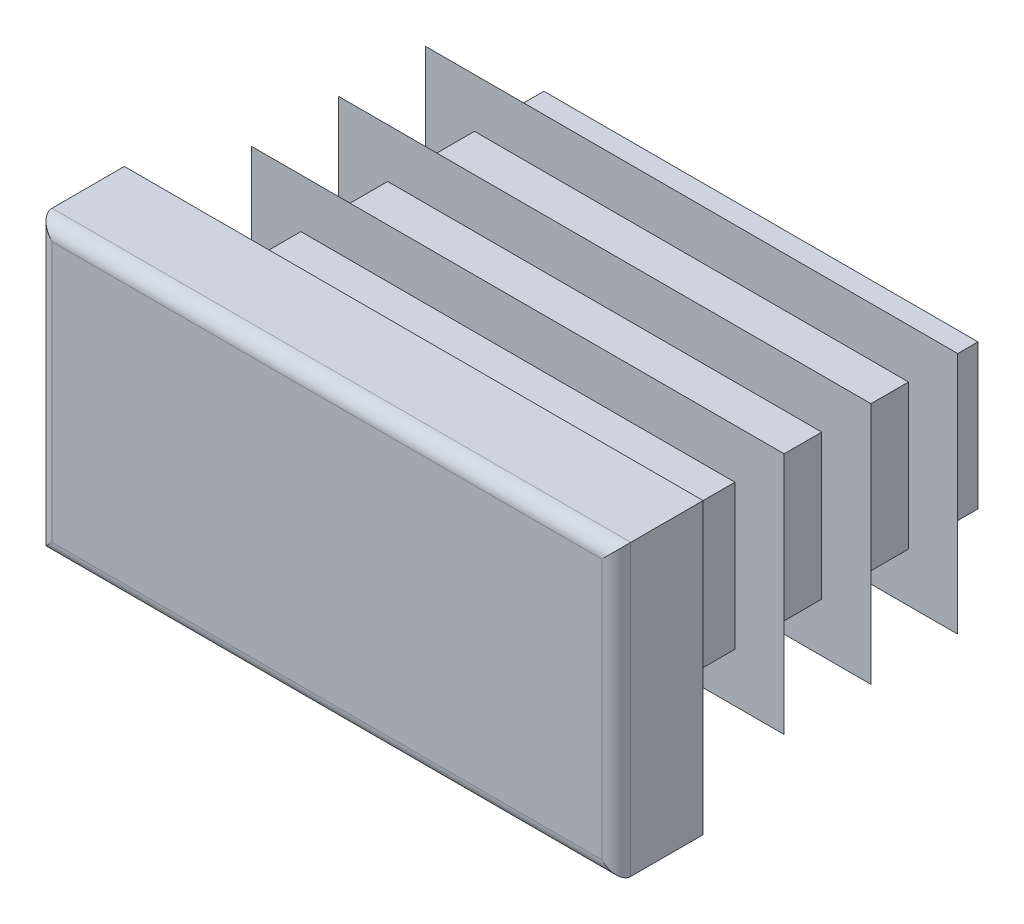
ISO-10303-21;
HEADER;
FILE_DESCRIPTION(('STEP AP214'),'2;1');
FILE_NAME('part.step','',(''),(''),'','','');
FILE_SCHEMA(('AUTOMOTIVE_DESIGN { 1 0 10303 214 1 1 1 1 }'));
ENDSEC;
DATA;
#1=APPLICATION_CONTEXT('core data for automotive mechanical design processes');
#2=APPLICATION_PROTOCOL_DEFINITION('international standard','automotive_design',2000,#1);
#3=PRODUCT_CONTEXT('',#1,'mechanical');
#4=PRODUCT('Part','Part','',(#3));
#5=PRODUCT_RELATED_PRODUCT_CATEGORY('part','',(#4));
#6=PRODUCT_DEFINITION_FORMATION('','',#4);
#7=PRODUCT_DEFINITION_CONTEXT('part definition',#1,'design');
#8=PRODUCT_DEFINITION('design','',#6,#7);
#9=PRODUCT_DEFINITION_SHAPE('','',#8);
#10=(LENGTH_UNIT() NAMED_UNIT(*) SI_UNIT(.MILLI.,.METRE.));
#11=(NAMED_UNIT(*) PLANE_ANGLE_UNIT() SI_UNIT($,.RADIAN.));
#12=(NAMED_UNIT(*) SI_UNIT($,.STERADIAN.) SOLID_ANGLE_UNIT());
#13=UNCERTAINTY_MEASURE_WITH_UNIT(LENGTH_MEASURE(1.E-05),#10,'distance_accuracy_value','');
#14=(GEOMETRIC_REPRESENTATION_CONTEXT(3) GLOBAL_UNCERTAINTY_ASSIGNED_CONTEXT((#13)) GLOBAL_UNIT_ASSIGNED_CONTEXT((#10,
#11,#12)) REPRESENTATION_CONTEXT('',''));
#15=CARTESIAN_POINT('',(0.,0.,0.));
#16=DIRECTION('',(0.,0.,1.));
#17=DIRECTION('',(1.,0.,0.));
#18=AXIS2_PLACEMENT_3D('',#15,#16,#17);
#19=CARTESIAN_POINT('',(9.5,-5.,3.));
#20=DIRECTION('',(0.,0.,-1.));
#21=DIRECTION('',(0.,1.,0.));
#22=AXIS2_PLACEMENT_3D('',#19,#20,#21);
#23=PLANE('',#22);
#24=DIRECTION('',(0.,1.,0.));
#25=VECTOR('',#24,1.);
#26=CARTESIAN_POINT('',(-9.5,-5.,3.));
#27=LINE('',#26,#25);
#28=CARTESIAN_POINT('',(-9.5,-4.5,3.));
#29=VERTEX_POINT('',#28);
#30=CARTESIAN_POINT('',(-9.5,4.5,3.));
#31=VERTEX_POINT('',#30);
#32=EDGE_CURVE('E310',#29,#31,#27,.T.);
#33=ORIENTED_EDGE('',*,*,#32,.F.);
#34=DIRECTION('',(-1.,0.,0.));
#35=VECTOR('',#34,1.);
#36=CARTESIAN_POINT('',(10.,-4.5,3.));
#37=LINE('',#36,#35);
#38=CARTESIAN_POINT('',(9.5,-4.5,3.));
#39=VERTEX_POINT('',#38);
#40=EDGE_CURVE('E482',#39,#29,#37,.T.);
#41=ORIENTED_EDGE('',*,*,#40,.F.);
#42=DIRECTION('',(0.,1.,0.));
#43=VECTOR('',#42,1.);
#44=CARTESIAN_POINT('',(9.5,-5.,3.));
#45=LINE('',#44,#43);
#46=CARTESIAN_POINT('',(9.5,4.5,3.));
#47=VERTEX_POINT('',#46);
#48=EDGE_CURVE('E305',#39,#47,#45,.T.);
#49=ORIENTED_EDGE('',*,*,#48,.T.);
#50=DIRECTION('',(-1.,0.,0.));
#51=VECTOR('',#50,1.);
#52=CARTESIAN_POINT('',(10.,4.5,3.));
#53=LINE('',#52,#51);
#54=EDGE_CURVE('E630',#47,#31,#53,.T.);
#55=ORIENTED_EDGE('',*,*,#54,.T.);
#56=EDGE_LOOP('',(#33,#41,#49,#55));
#57=FACE_BOUND('',#56,.T.);
#58=ADVANCED_FACE('F14',(#57),#23,.F.);
#59=CARTESIAN_POINT('',(-9.5,-5.,2.5));
#60=DIRECTION('',(0.,1.,0.));
#61=DIRECTION('',(-1.,0.,0.));
#62=AXIS2_PLACEMENT_3D('',#59,#60,#61);
#63=CYLINDRICAL_SURFACE('',#62,0.5);
#64=DIRECTION('',(0.,1.,0.));
#65=VECTOR('',#64,1.);
#66=CARTESIAN_POINT('',(-10.,-5.,2.5));
#67=LINE('',#66,#65);
#68=CARTESIAN_POINT('',(-10.,-5.,2.5));
#69=VERTEX_POINT('',#68);
#70=CARTESIAN_POINT('',(-10.,5.,2.5));
#71=VERTEX_POINT('',#70);
#72=EDGE_CURVE('E402',#69,#71,#67,.T.);
#73=ORIENTED_EDGE('',*,*,#72,.F.);
#74=CARTESIAN_POINT('',(-9.5,-4.5,2.5));
#75=DIRECTION('',(-0.707106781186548,0.707106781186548,0.));
#76=DIRECTION('',(0.707106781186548,0.707106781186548,0.));
#77=AXIS2_PLACEMENT_3D('',#74,#75,#76);
#78=ELLIPSE('',#77,0.707106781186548,0.5);
#79=EDGE_CURVE('E59',#69,#29,#78,.T.);
#80=ORIENTED_EDGE('',*,*,#79,.T.);
#81=ORIENTED_EDGE('',*,*,#32,.T.);
#82=CARTESIAN_POINT('',(-9.5,4.5,2.5));
#83=DIRECTION('',(0.707106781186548,0.707106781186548,0.));
#84=DIRECTION('',(-0.707106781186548,0.707106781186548,0.));
#85=AXIS2_PLACEMENT_3D('',#82,#83,#84);
#86=ELLIPSE('',#85,0.707106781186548,0.5);
#87=EDGE_CURVE('E306',#31,#71,#86,.F.);
#88=ORIENTED_EDGE('',*,*,#87,.T.);
#89=EDGE_LOOP('',(#73,#80,#81,#88));
#90=FACE_BOUND('',#89,.T.);
#91=ADVANCED_FACE('F16',(#90),#63,.T.);
#92=CARTESIAN_POINT('',(-10.,-5.,2.5));
#93=DIRECTION('',(1.,0.,0.));
#94=DIRECTION('',(0.,1.,0.));
#95=AXIS2_PLACEMENT_3D('',#92,#93,#94);
#96=PLANE('',#95);
#97=DIRECTION('',(0.,0.,-1.));
#98=VECTOR('',#97,1.);
#99=CARTESIAN_POINT('',(-10.,5.,2.5));
#100=LINE('',#99,#98);
#101=CARTESIAN_POINT('',(-10.,5.,0.));
#102=VERTEX_POINT('',#101);
#103=EDGE_CURVE('E615',#71,#102,#100,.T.);
#104=ORIENTED_EDGE('',*,*,#103,.T.);
#105=DIRECTION('',(0.,1.,0.));
#106=VECTOR('',#105,1.);
#107=CARTESIAN_POINT('',(-10.,-5.,0.));
#108=LINE('',#107,#106);
#109=CARTESIAN_POINT('',(-10.,-5.,0.));
#110=VERTEX_POINT('',#109);
#111=EDGE_CURVE('E400',#110,#102,#108,.T.);
#112=ORIENTED_EDGE('',*,*,#111,.F.);
#113=DIRECTION('',(0.,0.,-1.));
#114=VECTOR('',#113,1.);
#115=CARTESIAN_POINT('',(-10.,-5.,2.5));
#116=LINE('',#115,#114);
#117=EDGE_CURVE('E616',#69,#110,#116,.T.);
#118=ORIENTED_EDGE('',*,*,#117,.F.);
#119=ORIENTED_EDGE('',*,*,#72,.T.);
#120=EDGE_LOOP('',(#104,#112,#118,#119));
#121=FACE_BOUND('',#120,.T.);
#122=ADVANCED_FACE('F697',(#121),#96,.F.);
#123=CARTESIAN_POINT('',(-7.5,-5.,0.));
#124=DIRECTION('',(1.,0.,0.));
#125=DIRECTION('',(0.,1.,0.));
#126=AXIS2_PLACEMENT_3D('',#123,#124,#125);
#127=PLANE('',#126);
#128=DIRECTION('',(0.,1.,0.));
#129=VECTOR('',#128,1.);
#130=CARTESIAN_POINT('',(-7.5,-5.,0.));
#131=LINE('',#130,#129);
#132=CARTESIAN_POINT('',(-7.5,-2.5,0.));
#133=VERTEX_POINT('',#132);
#134=CARTESIAN_POINT('',(-7.5,2.5,0.));
#135=VERTEX_POINT('',#134);
#136=EDGE_CURVE('E397',#133,#135,#131,.T.);
#137=ORIENTED_EDGE('',*,*,#136,.T.);
#138=DIRECTION('',(0.,0.,-1.));
#139=VECTOR('',#138,1.);
#140=CARTESIAN_POINT('',(-7.5,2.5,0.));
#141=LINE('',#140,#139);
#142=CARTESIAN_POINT('',(-7.5,2.5,-0.6));
#143=VERTEX_POINT('',#142);
#144=EDGE_CURVE('E495',#135,#143,#141,.T.);
#145=ORIENTED_EDGE('',*,*,#144,.T.);
#146=DIRECTION('',(0.,1.,0.));
#147=VECTOR('',#146,1.);
#148=CARTESIAN_POINT('',(-7.5,-5.,-0.6));
#149=LINE('',#148,#147);
#150=CARTESIAN_POINT('',(-7.5,-2.5,-0.6));
#151=VERTEX_POINT('',#150);
#152=EDGE_CURVE('E394',#151,#143,#149,.T.);
#153=ORIENTED_EDGE('',*,*,#152,.F.);
#154=DIRECTION('',(0.,0.,1.));
#155=VECTOR('',#154,1.);
#156=CARTESIAN_POINT('',(-7.5,-2.5,0.));
#157=LINE('',#156,#155);
#158=EDGE_CURVE('E489',#151,#133,#157,.T.);
#159=ORIENTED_EDGE('',*,*,#158,.T.);
#160=EDGE_LOOP('',(#137,#145,#153,#159));
#161=FACE_BOUND('',#160,.T.);
#162=ADVANCED_FACE('F787',(#161),#127,.F.);
#163=CARTESIAN_POINT('',(-9.2,-5.,-0.6));
#164=DIRECTION('',(0.342020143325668,0.,0.939692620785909));
#165=DIRECTION('',(-0.939692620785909,0.,0.342020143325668));
#166=AXIS2_PLACEMENT_3D('',#163,#164,#165);
#167=PLANE('',#166);
#168=DIRECTION('',(0.,1.,0.));
#169=VECTOR('',#168,1.);
#170=CARTESIAN_POINT('',(-9.2,-5.,-0.6));
#171=LINE('',#170,#169);
#172=CARTESIAN_POINT('',(-9.2,-4.2,-0.6));
#173=VERTEX_POINT('',#172);
#174=CARTESIAN_POINT('',(-9.2,4.2,-0.6));
#175=VERTEX_POINT('',#174);
#176=EDGE_CURVE('E392',#173,#175,#171,.T.);
#177=ORIENTED_EDGE('',*,*,#176,.T.);
#178=DIRECTION('',(0.844349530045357,-0.43889572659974,-0.307318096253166));
#179=VECTOR('',#178,1.);
#180=CARTESIAN_POINT('',(-5.79065111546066,2.42780897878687,-1.840901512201));
#181=LINE('',#180,#179);
#182=CARTESIAN_POINT('',(-7.5,3.31633428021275,-1.21874939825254));
#183=VERTEX_POINT('',#182);
#184=EDGE_CURVE('E519',#175,#183,#181,.T.);
#185=ORIENTED_EDGE('',*,*,#184,.T.);
#186=DIRECTION('',(0.,1.,0.));
#187=VECTOR('',#186,1.);
#188=CARTESIAN_POINT('',(-7.5,-5.,-1.21874939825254));
#189=LINE('',#188,#187);
#190=CARTESIAN_POINT('',(-7.5,-3.31633428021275,-1.21874939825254));
#191=VERTEX_POINT('',#190);
#192=EDGE_CURVE('E389',#191,#183,#189,.T.);
#193=ORIENTED_EDGE('',*,*,#192,.F.);
#194=DIRECTION('',(-0.844349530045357,-0.43889572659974,0.307318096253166));
#195=VECTOR('',#194,1.);
#196=CARTESIAN_POINT('',(-9.49646512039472,-4.35410356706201,-0.492095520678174));
#197=LINE('',#196,#195);
#198=EDGE_CURVE('E507',#191,#173,#197,.T.);
#199=ORIENTED_EDGE('',*,*,#198,.T.);
#200=EDGE_LOOP('',(#177,#185,#193,#199));
#201=FACE_BOUND('',#200,.T.);
#202=ADVANCED_FACE('F783',(#201),#167,.F.);
#203=CARTESIAN_POINT('',(-7.5,-5.,-1.21874939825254));
#204=DIRECTION('',(1.,0.,0.));
#205=DIRECTION('',(0.,1.,0.));
#206=AXIS2_PLACEMENT_3D('',#203,#204,#205);
#207=PLANE('',#206);
#208=ORIENTED_EDGE('',*,*,#192,.T.);
#209=DIRECTION('',(0.,-0.819152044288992,-0.573576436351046));
#210=VECTOR('',#209,1.);
#211=CARTESIAN_POINT('',(-7.5,-2.26400978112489,-5.12614837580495));
#212=LINE('',#211,#210);
#213=CARTESIAN_POINT('',(-7.5,2.5,-1.79035281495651));
#214=VERTEX_POINT('',#213);
#215=EDGE_CURVE('E516',#183,#214,#212,.T.);
#216=ORIENTED_EDGE('',*,*,#215,.T.);
#217=DIRECTION('',(0.,0.,-1.));
#218=VECTOR('',#217,1.);
#219=CARTESIAN_POINT('',(-7.5,2.5,-1.21874939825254));
#220=LINE('',#219,#218);
#221=CARTESIAN_POINT('',(-7.5,2.5,-3.6));
#222=VERTEX_POINT('',#221);
#223=EDGE_CURVE('E525',#214,#222,#220,.T.);
#224=ORIENTED_EDGE('',*,*,#223,.T.);
#225=DIRECTION('',(0.,1.,0.));
#226=VECTOR('',#225,1.);
#227=CARTESIAN_POINT('',(-7.5,-5.,-3.6));
#228=LINE('',#227,#226);
#229=CARTESIAN_POINT('',(-7.5,-2.5,-3.6));
#230=VERTEX_POINT('',#229);
#231=EDGE_CURVE('E386',#230,#222,#228,.T.);
#232=ORIENTED_EDGE('',*,*,#231,.F.);
#233=DIRECTION('',(0.,0.,1.));
#234=VECTOR('',#233,1.);
#235=CARTESIAN_POINT('',(-7.5,-2.5,-1.21874939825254));
#236=LINE('',#235,#234);
#237=CARTESIAN_POINT('',(-7.5,-2.5,-1.79035281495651));
#238=VERTEX_POINT('',#237);
#239=EDGE_CURVE('E522',#230,#238,#236,.T.);
#240=ORIENTED_EDGE('',*,*,#239,.T.);
#241=DIRECTION('',(0.,-0.819152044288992,0.573576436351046));
#242=VECTOR('',#241,1.);
#243=CARTESIAN_POINT('',(-7.5,-4.44609093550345,-0.427685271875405));
#244=LINE('',#243,#242);
#245=EDGE_CURVE('E504',#238,#191,#244,.T.);
#246=ORIENTED_EDGE('',*,*,#245,.T.);
#247=EDGE_LOOP('',(#208,#216,#224,#232,#240,#246));
#248=FACE_BOUND('',#247,.T.);
#249=ADVANCED_FACE('F779',(#248),#207,.F.);
#250=CARTESIAN_POINT('',(-9.2,-5.,-3.6));
#251=DIRECTION('',(0.342020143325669,0.,0.939692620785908));
#252=DIRECTION('',(-0.939692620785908,0.,0.342020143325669));
#253=AXIS2_PLACEMENT_3D('',#250,#251,#252);
#254=PLANE('',#253);
#255=DIRECTION('',(0.,1.,0.));
#256=VECTOR('',#255,1.);
#257=CARTESIAN_POINT('',(-9.2,-5.,-3.6));
#258=LINE('',#257,#256);
#259=CARTESIAN_POINT('',(-9.2,-4.2,-3.6));
#260=VERTEX_POINT('',#259);
#261=CARTESIAN_POINT('',(-9.2,4.2,-3.6));
#262=VERTEX_POINT('',#261);
#263=EDGE_CURVE('E384',#260,#262,#258,.T.);
#264=ORIENTED_EDGE('',*,*,#263,.T.);
#265=DIRECTION('',(0.844349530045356,-0.438895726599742,-0.307318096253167));
#266=VECTOR('',#265,1.);
#267=CARTESIAN_POINT('',(-5.79065111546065,2.42780897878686,-4.84090151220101));
#268=LINE('',#267,#266);
#269=CARTESIAN_POINT('',(-7.5,3.31633428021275,-4.21874939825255));
#270=VERTEX_POINT('',#269);
#271=EDGE_CURVE('E549',#262,#270,#268,.T.);
#272=ORIENTED_EDGE('',*,*,#271,.T.);
#273=DIRECTION('',(0.,1.,0.));
#274=VECTOR('',#273,1.);
#275=CARTESIAN_POINT('',(-7.5,-5.,-4.21874939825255));
#276=LINE('',#275,#274);
#277=CARTESIAN_POINT('',(-7.5,-3.31633428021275,-4.21874939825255));
#278=VERTEX_POINT('',#277);
#279=EDGE_CURVE('E381',#278,#270,#276,.T.);
#280=ORIENTED_EDGE('',*,*,#279,.F.);
#281=DIRECTION('',(-0.844349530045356,-0.438895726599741,0.307318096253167));
#282=VECTOR('',#281,1.);
#283=CARTESIAN_POINT('',(-9.49646512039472,-4.35410356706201,-3.49209552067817));
#284=LINE('',#283,#282);
#285=EDGE_CURVE('E537',#278,#260,#284,.T.);
#286=ORIENTED_EDGE('',*,*,#285,.T.);
#287=EDGE_LOOP('',(#264,#272,#280,#286));
#288=FACE_BOUND('',#287,.T.);
#289=ADVANCED_FACE('F775',(#288),#254,.F.);
#290=CARTESIAN_POINT('',(-7.5,-5.,-4.21874939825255));
#291=DIRECTION('',(1.,0.,0.));
#292=DIRECTION('',(0.,1.,0.));
#293=AXIS2_PLACEMENT_3D('',#290,#291,#292);
#294=PLANE('',#293);
#295=ORIENTED_EDGE('',*,*,#279,.T.);
#296=DIRECTION('',(0.,-0.819152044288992,-0.573576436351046));
#297=VECTOR('',#296,1.);
#298=CARTESIAN_POINT('',(-7.5,-2.2640097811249,-8.12614837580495));
#299=LINE('',#298,#297);
#300=CARTESIAN_POINT('',(-7.5,2.5,-4.79035281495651));
#301=VERTEX_POINT('',#300);
#302=EDGE_CURVE('E546',#270,#301,#299,.T.);
#303=ORIENTED_EDGE('',*,*,#302,.T.);
#304=DIRECTION('',(0.,0.,-1.));
#305=VECTOR('',#304,1.);
#306=CARTESIAN_POINT('',(-7.5,2.5,-4.21874939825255));
#307=LINE('',#306,#305);
#308=CARTESIAN_POINT('',(-7.5,2.5,-6.6));
#309=VERTEX_POINT('',#308);
#310=EDGE_CURVE('E555',#301,#309,#307,.T.);
#311=ORIENTED_EDGE('',*,*,#310,.T.);
#312=DIRECTION('',(0.,1.,0.));
#313=VECTOR('',#312,1.);
#314=CARTESIAN_POINT('',(-7.5,-5.,-6.6));
#315=LINE('',#314,#313);
#316=CARTESIAN_POINT('',(-7.5,-2.5,-6.6));
#317=VERTEX_POINT('',#316);
#318=EDGE_CURVE('E378',#317,#309,#315,.T.);
#319=ORIENTED_EDGE('',*,*,#318,.F.);
#320=DIRECTION('',(0.,0.,1.));
#321=VECTOR('',#320,1.);
#322=CARTESIAN_POINT('',(-7.5,-2.5,-4.21874939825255));
#323=LINE('',#322,#321);
#324=CARTESIAN_POINT('',(-7.5,-2.5,-4.79035281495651));
#325=VERTEX_POINT('',#324);
#326=EDGE_CURVE('E552',#317,#325,#323,.T.);
#327=ORIENTED_EDGE('',*,*,#326,.T.);
#328=DIRECTION('',(0.,-0.819152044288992,0.573576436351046));
#329=VECTOR('',#328,1.);
#330=CARTESIAN_POINT('',(-7.5,-4.44609093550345,-3.42768527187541));
#331=LINE('',#330,#329);
#332=EDGE_CURVE('E534',#325,#278,#331,.T.);
#333=ORIENTED_EDGE('',*,*,#332,.T.);
#334=EDGE_LOOP('',(#295,#303,#311,#319,#327,#333));
#335=FACE_BOUND('',#334,.T.);
#336=ADVANCED_FACE('F771',(#335),#294,.F.);
#337=CARTESIAN_POINT('',(-9.2,-5.,-6.6));
#338=DIRECTION('',(0.342020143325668,0.,0.939692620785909));
#339=DIRECTION('',(-0.939692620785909,0.,0.342020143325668));
#340=AXIS2_PLACEMENT_3D('',#337,#338,#339);
#341=PLANE('',#340);
#342=DIRECTION('',(0.,1.,0.));
#343=VECTOR('',#342,1.);
#344=CARTESIAN_POINT('',(-9.2,-5.,-6.6));
#345=LINE('',#344,#343);
#346=CARTESIAN_POINT('',(-9.2,-4.2,-6.6));
#347=VERTEX_POINT('',#346);
#348=CARTESIAN_POINT('',(-9.2,4.2,-6.6));
#349=VERTEX_POINT('',#348);
#350=EDGE_CURVE('E376',#347,#349,#345,.T.);
#351=ORIENTED_EDGE('',*,*,#350,.T.);
#352=DIRECTION('',(0.844349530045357,-0.43889572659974,-0.307318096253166));
#353=VECTOR('',#352,1.);
#354=CARTESIAN_POINT('',(-5.79065111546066,2.42780897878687,-7.840901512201));
#355=LINE('',#354,#353);
#356=CARTESIAN_POINT('',(-7.5,3.31633428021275,-7.21874939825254));
#357=VERTEX_POINT('',#356);
#358=EDGE_CURVE('E579',#349,#357,#355,.T.);
#359=ORIENTED_EDGE('',*,*,#358,.T.);
#360=DIRECTION('',(0.,1.,0.));
#361=VECTOR('',#360,1.);
#362=CARTESIAN_POINT('',(-7.5,-5.,-7.21874939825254));
#363=LINE('',#362,#361);
#364=CARTESIAN_POINT('',(-7.5,-3.31633428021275,-7.21874939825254));
#365=VERTEX_POINT('',#364);
#366=EDGE_CURVE('E373',#365,#357,#363,.T.);
#367=ORIENTED_EDGE('',*,*,#366,.F.);
#368=DIRECTION('',(-0.844349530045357,-0.43889572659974,0.307318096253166));
#369=VECTOR('',#368,1.);
#370=CARTESIAN_POINT('',(-9.49646512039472,-4.35410356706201,-6.49209552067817));
#371=LINE('',#370,#369);
#372=EDGE_CURVE('E567',#365,#347,#371,.T.);
#373=ORIENTED_EDGE('',*,*,#372,.T.);
#374=EDGE_LOOP('',(#351,#359,#367,#373));
#375=FACE_BOUND('',#374,.T.);
#376=ADVANCED_FACE('F767',(#375),#341,.F.);
#377=CARTESIAN_POINT('',(-7.5,-5.,-7.21874939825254));
#378=DIRECTION('',(1.,0.,0.));
#379=DIRECTION('',(0.,1.,0.));
#380=AXIS2_PLACEMENT_3D('',#377,#378,#379);
#381=PLANE('',#380);
#382=ORIENTED_EDGE('',*,*,#366,.T.);
#383=DIRECTION('',(0.,-0.819152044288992,-0.573576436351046));
#384=VECTOR('',#383,1.);
#385=CARTESIAN_POINT('',(-7.5,-2.26400978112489,-11.1261483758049));
#386=LINE('',#385,#384);
#387=CARTESIAN_POINT('',(-7.5,2.5,-7.79035281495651));
#388=VERTEX_POINT('',#387);
#389=EDGE_CURVE('E576',#357,#388,#386,.T.);
#390=ORIENTED_EDGE('',*,*,#389,.T.);
#391=DIRECTION('',(0.,0.,-1.));
#392=VECTOR('',#391,1.);
#393=CARTESIAN_POINT('',(-7.5,2.5,-7.21874939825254));
#394=LINE('',#393,#392);
#395=CARTESIAN_POINT('',(-7.5,2.5,-9.6));
#396=VERTEX_POINT('',#395);
#397=EDGE_CURVE('E585',#388,#396,#394,.T.);
#398=ORIENTED_EDGE('',*,*,#397,.T.);
#399=DIRECTION('',(0.,1.,0.));
#400=VECTOR('',#399,1.);
#401=CARTESIAN_POINT('',(-7.5,-5.,-9.6));
#402=LINE('',#401,#400);
#403=CARTESIAN_POINT('',(-7.5,-2.5,-9.6));
#404=VERTEX_POINT('',#403);
#405=EDGE_CURVE('E370',#404,#396,#402,.T.);
#406=ORIENTED_EDGE('',*,*,#405,.F.);
#407=DIRECTION('',(0.,0.,1.));
#408=VECTOR('',#407,1.);
#409=CARTESIAN_POINT('',(-7.5,-2.5,-7.21874939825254));
#410=LINE('',#409,#408);
#411=CARTESIAN_POINT('',(-7.5,-2.5,-7.79035281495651));
#412=VERTEX_POINT('',#411);
#413=EDGE_CURVE('E582',#404,#412,#410,.T.);
#414=ORIENTED_EDGE('',*,*,#413,.T.);
#415=DIRECTION('',(0.,-0.819152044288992,0.573576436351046));
#416=VECTOR('',#415,1.);
#417=CARTESIAN_POINT('',(-7.5,-4.44609093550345,-6.42768527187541));
#418=LINE('',#417,#416);
#419=EDGE_CURVE('E564',#412,#365,#418,.T.);
#420=ORIENTED_EDGE('',*,*,#419,.T.);
#421=EDGE_LOOP('',(#382,#390,#398,#406,#414,#420));
#422=FACE_BOUND('',#421,.T.);
#423=ADVANCED_FACE('F764',(#422),#381,.F.);
#424=CARTESIAN_POINT('',(-9.2,-5.,-9.6));
#425=DIRECTION('',(0.342020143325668,0.,0.939692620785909));
#426=DIRECTION('',(-0.939692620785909,0.,0.342020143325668));
#427=AXIS2_PLACEMENT_3D('',#424,#425,#426);
#428=PLANE('',#427);
#429=DIRECTION('',(0.,1.,0.));
#430=VECTOR('',#429,1.);
#431=CARTESIAN_POINT('',(-9.2,-5.,-9.6));
#432=LINE('',#431,#430);
#433=CARTESIAN_POINT('',(-9.2,-4.2,-9.6));
#434=VERTEX_POINT('',#433);
#435=CARTESIAN_POINT('',(-9.2,4.2,-9.6));
#436=VERTEX_POINT('',#435);
#437=EDGE_CURVE('E368',#434,#436,#432,.T.);
#438=ORIENTED_EDGE('',*,*,#437,.T.);
#439=DIRECTION('',(0.844349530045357,-0.438895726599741,-0.307318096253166));
#440=VECTOR('',#439,1.);
#441=CARTESIAN_POINT('',(-5.79065111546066,2.42780897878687,-10.840901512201));
#442=LINE('',#441,#440);
#443=CARTESIAN_POINT('',(-7.5,3.31633428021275,-10.2187493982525));
#444=VERTEX_POINT('',#443);
#445=EDGE_CURVE('E607',#436,#444,#442,.T.);
#446=ORIENTED_EDGE('',*,*,#445,.T.);
#447=DIRECTION('',(0.,1.,0.));
#448=VECTOR('',#447,1.);
#449=CARTESIAN_POINT('',(-7.5,-5.,-10.2187493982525));
#450=LINE('',#449,#448);
#451=CARTESIAN_POINT('',(-7.5,-3.31633428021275,-10.2187493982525));
#452=VERTEX_POINT('',#451);
#453=EDGE_CURVE('E365',#452,#444,#450,.T.);
#454=ORIENTED_EDGE('',*,*,#453,.F.);
#455=DIRECTION('',(-0.844349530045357,-0.438895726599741,0.307318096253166));
#456=VECTOR('',#455,1.);
#457=CARTESIAN_POINT('',(-9.49646512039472,-4.35410356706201,-9.49209552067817));
#458=LINE('',#457,#456);
#459=EDGE_CURVE('E595',#452,#434,#458,.T.);
#460=ORIENTED_EDGE('',*,*,#459,.T.);
#461=EDGE_LOOP('',(#438,#446,#454,#460));
#462=FACE_BOUND('',#461,.T.);
#463=ADVANCED_FACE('F675',(#462),#428,.F.);
#464=CARTESIAN_POINT('',(-7.5,-5.,-10.2187493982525));
#465=DIRECTION('',(1.,0.,0.));
#466=DIRECTION('',(0.,1.,0.));
#467=AXIS2_PLACEMENT_3D('',#464,#465,#466);
#468=PLANE('',#467);
#469=ORIENTED_EDGE('',*,*,#453,.T.);
#470=DIRECTION('',(0.,-0.819152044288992,-0.573576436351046));
#471=VECTOR('',#470,1.);
#472=CARTESIAN_POINT('',(-7.5,-2.26400978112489,-14.1261483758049));
#473=LINE('',#472,#471);
#474=CARTESIAN_POINT('',(-7.5,2.5,-10.7903528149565));
#475=VERTEX_POINT('',#474);
#476=EDGE_CURVE('E604',#444,#475,#473,.T.);
#477=ORIENTED_EDGE('',*,*,#476,.T.);
#478=DIRECTION('',(0.,0.,-1.));
#479=VECTOR('',#478,1.);
#480=CARTESIAN_POINT('',(-7.5,2.5,-10.2187493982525));
#481=LINE('',#480,#479);
#482=CARTESIAN_POINT('',(-7.5,2.5,-12.));
#483=VERTEX_POINT('',#482);
#484=EDGE_CURVE('E613',#475,#483,#481,.T.);
#485=ORIENTED_EDGE('',*,*,#484,.T.);
#486=DIRECTION('',(0.,1.,0.));
#487=VECTOR('',#486,1.);
#488=CARTESIAN_POINT('',(-7.5,-5.,-12.));
#489=LINE('',#488,#487);
#490=CARTESIAN_POINT('',(-7.5,-2.5,-12.));
#491=VERTEX_POINT('',#490);
#492=EDGE_CURVE('E362',#491,#483,#489,.T.);
#493=ORIENTED_EDGE('',*,*,#492,.F.);
#494=DIRECTION('',(0.,0.,1.));
#495=VECTOR('',#494,1.);
#496=CARTESIAN_POINT('',(-7.5,-2.5,-10.2187493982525));
#497=LINE('',#496,#495);
#498=CARTESIAN_POINT('',(-7.5,-2.5,-10.7903528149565));
#499=VERTEX_POINT('',#498);
#500=EDGE_CURVE('E610',#491,#499,#497,.T.);
#501=ORIENTED_EDGE('',*,*,#500,.T.);
#502=DIRECTION('',(0.,-0.819152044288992,0.573576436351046));
#503=VECTOR('',#502,1.);
#504=CARTESIAN_POINT('',(-7.5,-4.44609093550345,-9.4276852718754));
#505=LINE('',#504,#503);
#506=EDGE_CURVE('E592',#499,#452,#505,.T.);
#507=ORIENTED_EDGE('',*,*,#506,.T.);
#508=EDGE_LOOP('',(#469,#477,#485,#493,#501,#507));
#509=FACE_BOUND('',#508,.T.);
#510=ADVANCED_FACE('F677',(#509),#468,.F.);
#511=CARTESIAN_POINT('',(-7.5,-5.,-12.));
#512=DIRECTION('',(0.,0.,1.));
#513=DIRECTION('',(0.,-1.,0.));
#514=AXIS2_PLACEMENT_3D('',#511,#512,#513);
#515=PLANE('',#514);
#516=ORIENTED_EDGE('',*,*,#492,.T.);
#517=DIRECTION('',(-1.,0.,0.));
#518=VECTOR('',#517,1.);
#519=CARTESIAN_POINT('',(10.,2.5,-12.));
#520=LINE('',#519,#518);
#521=CARTESIAN_POINT('',(7.5,2.5,-12.));
#522=VERTEX_POINT('',#521);
#523=EDGE_CURVE('E438',#522,#483,#520,.T.);
#524=ORIENTED_EDGE('',*,*,#523,.F.);
#525=DIRECTION('',(0.,1.,0.));
#526=VECTOR('',#525,1.);
#527=CARTESIAN_POINT('',(7.5,-5.,-12.));
#528=LINE('',#527,#526);
#529=CARTESIAN_POINT('',(7.5,-2.5,-12.));
#530=VERTEX_POINT('',#529);
#531=EDGE_CURVE('E359',#530,#522,#528,.T.);
#532=ORIENTED_EDGE('',*,*,#531,.F.);
#533=DIRECTION('',(-1.,0.,0.));
#534=VECTOR('',#533,1.);
#535=CARTESIAN_POINT('',(10.,-2.5,-12.));
#536=LINE('',#535,#534);
#537=EDGE_CURVE('E436',#530,#491,#536,.T.);
#538=ORIENTED_EDGE('',*,*,#537,.T.);
#539=EDGE_LOOP('',(#516,#524,#532,#538));
#540=FACE_BOUND('',#539,.T.);
#541=ADVANCED_FACE('F435',(#540),#515,.F.);
#542=CARTESIAN_POINT('',(7.5,-5.,-12.));
#543=DIRECTION('',(-1.,0.,0.));
#544=DIRECTION('',(0.,-1.,0.));
#545=AXIS2_PLACEMENT_3D('',#542,#543,#544);
#546=PLANE('',#545);
#547=DIRECTION('',(0.,0.,1.));
#548=VECTOR('',#547,1.);
#549=CARTESIAN_POINT('',(7.5,2.5,-12.));
#550=LINE('',#549,#548);
#551=CARTESIAN_POINT('',(7.5,2.5,-10.7903528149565));
#552=VERTEX_POINT('',#551);
#553=EDGE_CURVE('E9',#522,#552,#550,.T.);
#554=ORIENTED_EDGE('',*,*,#553,.T.);
#555=DIRECTION('',(0.,0.819152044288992,0.573576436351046));
#556=VECTOR('',#555,1.);
#557=CARTESIAN_POINT('',(7.5,-3.10092380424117,-14.7121618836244));
#558=LINE('',#557,#556);
#559=CARTESIAN_POINT('',(7.5,3.31633428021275,-10.2187493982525));
#560=VERTEX_POINT('',#559);
#561=EDGE_CURVE('E601',#552,#560,#558,.T.);
#562=ORIENTED_EDGE('',*,*,#561,.T.);
#563=DIRECTION('',(0.,1.,0.));
#564=VECTOR('',#563,1.);
#565=CARTESIAN_POINT('',(7.5,-5.,-10.2187493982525));
#566=LINE('',#565,#564);
#567=CARTESIAN_POINT('',(7.5,-3.31633428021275,-10.2187493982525));
#568=VERTEX_POINT('',#567);
#569=EDGE_CURVE('E356',#568,#560,#566,.T.);
#570=ORIENTED_EDGE('',*,*,#569,.F.);
#571=DIRECTION('',(0.,0.819152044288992,-0.573576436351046));
#572=VECTOR('',#571,1.);
#573=CARTESIAN_POINT('',(7.5,-3.60917691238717,-10.0136987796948));
#574=LINE('',#573,#572);
#575=CARTESIAN_POINT('',(7.5,-2.5,-10.7903528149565));
#576=VERTEX_POINT('',#575);
#577=EDGE_CURVE('E428',#568,#576,#574,.T.);
#578=ORIENTED_EDGE('',*,*,#577,.T.);
#579=DIRECTION('',(0.,0.,-1.));
#580=VECTOR('',#579,1.);
#581=CARTESIAN_POINT('',(7.5,-2.5,-12.));
#582=LINE('',#581,#580);
#583=EDGE_CURVE('E23',#576,#530,#582,.T.);
#584=ORIENTED_EDGE('',*,*,#583,.T.);
#585=ORIENTED_EDGE('',*,*,#531,.T.);
#586=EDGE_LOOP('',(#554,#562,#570,#578,#584,#585));
#587=FACE_BOUND('',#586,.T.);
#588=ADVANCED_FACE('F426',(#587),#546,.F.);
#589=CARTESIAN_POINT('',(7.5,-5.,-10.2187493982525));
#590=DIRECTION('',(-0.342020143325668,0.,0.939692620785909));
#591=DIRECTION('',(-0.939692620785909,0.,-0.342020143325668));
#592=AXIS2_PLACEMENT_3D('',#589,#590,#591);
#593=PLANE('',#592);
#594=ORIENTED_EDGE('',*,*,#569,.T.);
#595=DIRECTION('',(0.844349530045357,0.438895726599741,0.307318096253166));
#596=VECTOR('',#595,1.);
#597=CARTESIAN_POINT('',(4.41812119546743,1.71436330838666,-11.3404615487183));
#598=LINE('',#597,#596);
#599=CARTESIAN_POINT('',(9.2,4.2,-9.6));
#600=VERTEX_POINT('',#599);
#601=EDGE_CURVE('E598',#560,#600,#598,.T.);
#602=ORIENTED_EDGE('',*,*,#601,.T.);
#603=DIRECTION('',(0.,1.,0.));
#604=VECTOR('',#603,1.);
#605=CARTESIAN_POINT('',(9.2,-5.,-9.6));
#606=LINE('',#605,#604);
#607=CARTESIAN_POINT('',(9.2,-4.2,-9.6));
#608=VERTEX_POINT('',#607);
#609=EDGE_CURVE('E353',#608,#600,#606,.T.);
#610=ORIENTED_EDGE('',*,*,#609,.F.);
#611=DIRECTION('',(-0.844349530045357,0.438895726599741,-0.307318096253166));
#612=VECTOR('',#611,1.);
#613=CARTESIAN_POINT('',(8.1239352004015,-3.6406578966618,-9.99165555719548));
#614=LINE('',#613,#612);
#615=EDGE_CURVE('E588',#608,#568,#614,.T.);
#616=ORIENTED_EDGE('',*,*,#615,.T.);
#617=EDGE_LOOP('',(#594,#602,#610,#616));
#618=FACE_BOUND('',#617,.T.);
#619=ADVANCED_FACE('F752',(#618),#593,.F.);
#620=CARTESIAN_POINT('',(9.2,-5.,-9.6));
#621=DIRECTION('',(0.,0.,-1.));
#622=DIRECTION('',(0.,1.,0.));
#623=AXIS2_PLACEMENT_3D('',#620,#621,#622);
#624=PLANE('',#623);
#625=ORIENTED_EDGE('',*,*,#609,.T.);
#626=DIRECTION('',(-1.,0.,0.));
#627=VECTOR('',#626,1.);
#628=CARTESIAN_POINT('',(10.,4.2,-9.6));
#629=LINE('',#628,#627);
#630=EDGE_CURVE('E444',#600,#436,#629,.T.);
#631=ORIENTED_EDGE('',*,*,#630,.T.);
#632=ORIENTED_EDGE('',*,*,#437,.F.);
#633=DIRECTION('',(-1.,0.,0.));
#634=VECTOR('',#633,1.);
#635=CARTESIAN_POINT('',(10.,-4.2,-9.6));
#636=LINE('',#635,#634);
#637=EDGE_CURVE('E451',#608,#434,#636,.T.);
#638=ORIENTED_EDGE('',*,*,#637,.F.);
#639=EDGE_LOOP('',(#625,#631,#632,#638));
#640=FACE_BOUND('',#639,.T.);
#641=ORIENTED_EDGE('',*,*,#405,.T.);
#642=DIRECTION('',(-1.,0.,0.));
#643=VECTOR('',#642,1.);
#644=CARTESIAN_POINT('',(10.,2.5,-9.6));
#645=LINE('',#644,#643);
#646=CARTESIAN_POINT('',(7.5,2.5,-9.6));
#647=VERTEX_POINT('',#646);
#648=EDGE_CURVE('E663',#647,#396,#645,.T.);
#649=ORIENTED_EDGE('',*,*,#648,.F.);
#650=DIRECTION('',(0.,1.,0.));
#651=VECTOR('',#650,1.);
#652=CARTESIAN_POINT('',(7.5,-5.,-9.6));
#653=LINE('',#652,#651);
#654=CARTESIAN_POINT('',(7.5,-2.5,-9.6));
#655=VERTEX_POINT('',#654);
#656=EDGE_CURVE('E350',#655,#647,#653,.T.);
#657=ORIENTED_EDGE('',*,*,#656,.F.);
#658=DIRECTION('',(-1.,0.,0.));
#659=VECTOR('',#658,1.);
#660=CARTESIAN_POINT('',(10.,-2.5,-9.6));
#661=LINE('',#660,#659);
#662=EDGE_CURVE('E453',#655,#404,#661,.T.);
#663=ORIENTED_EDGE('',*,*,#662,.T.);
#664=EDGE_LOOP('',(#641,#649,#657,#663));
#665=FACE_BOUND('',#664,.T.);
#666=ADVANCED_FACE('F667',(#640,#665),#624,.F.);
#667=CARTESIAN_POINT('',(7.5,-5.,-9.6));
#668=DIRECTION('',(-1.,0.,0.));
#669=DIRECTION('',(0.,-1.,0.));
#670=AXIS2_PLACEMENT_3D('',#667,#668,#669);
#671=PLANE('',#670);
#672=DIRECTION('',(0.,0.,1.));
#673=VECTOR('',#672,1.);
#674=CARTESIAN_POINT('',(7.5,2.5,-9.6));
#675=LINE('',#674,#673);
#676=CARTESIAN_POINT('',(7.5,2.5,-7.79035281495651));
#677=VERTEX_POINT('',#676);
#678=EDGE_CURVE('E420',#647,#677,#675,.T.);
#679=ORIENTED_EDGE('',*,*,#678,.T.);
#680=DIRECTION('',(0.,0.819152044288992,0.573576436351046));
#681=VECTOR('',#680,1.);
#682=CARTESIAN_POINT('',(7.5,-3.38283159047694,-11.9095558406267));
#683=LINE('',#682,#681);
#684=CARTESIAN_POINT('',(7.5,3.31633428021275,-7.21874939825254));
#685=VERTEX_POINT('',#684);
#686=EDGE_CURVE('E573',#677,#685,#683,.T.);
#687=ORIENTED_EDGE('',*,*,#686,.T.);
#688=DIRECTION('',(0.,1.,0.));
#689=VECTOR('',#688,1.);
#690=CARTESIAN_POINT('',(7.5,-5.,-7.21874939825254));
#691=LINE('',#690,#689);
#692=CARTESIAN_POINT('',(7.5,-3.31633428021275,-7.21874939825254));
#693=VERTEX_POINT('',#692);
#694=EDGE_CURVE('E347',#693,#685,#691,.T.);
#695=ORIENTED_EDGE('',*,*,#694,.F.);
#696=DIRECTION('',(0.,0.819152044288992,-0.573576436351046));
#697=VECTOR('',#696,1.);
#698=CARTESIAN_POINT('',(7.5,-3.3272691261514,-7.21109273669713));
#699=LINE('',#698,#697);
#700=CARTESIAN_POINT('',(7.5,-2.5,-7.79035281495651));
#701=VERTEX_POINT('',#700);
#702=EDGE_CURVE('E561',#693,#701,#699,.T.);
#703=ORIENTED_EDGE('',*,*,#702,.T.);
#704=DIRECTION('',(0.,0.,-1.));
#705=VECTOR('',#704,1.);
#706=CARTESIAN_POINT('',(7.5,-2.5,-9.6));
#707=LINE('',#706,#705);
#708=EDGE_CURVE('E417',#701,#655,#707,.T.);
#709=ORIENTED_EDGE('',*,*,#708,.T.);
#710=ORIENTED_EDGE('',*,*,#656,.T.);
#711=EDGE_LOOP('',(#679,#687,#695,#703,#709,#710));
#712=FACE_BOUND('',#711,.T.);
#713=ADVANCED_FACE('F745',(#712),#671,.F.);
#714=CARTESIAN_POINT('',(7.5,-5.,-7.21874939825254));
#715=DIRECTION('',(-0.342020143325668,0.,0.939692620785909));
#716=DIRECTION('',(-0.939692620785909,0.,-0.342020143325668));
#717=AXIS2_PLACEMENT_3D('',#714,#715,#716);
#718=PLANE('',#717);
#719=ORIENTED_EDGE('',*,*,#694,.T.);
#720=DIRECTION('',(0.844349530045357,0.43889572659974,0.307318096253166));
#721=VECTOR('',#720,1.);
#722=CARTESIAN_POINT('',(4.41812119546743,1.71436330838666,-8.3404615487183));
#723=LINE('',#722,#721);
#724=CARTESIAN_POINT('',(9.2,4.2,-6.6));
#725=VERTEX_POINT('',#724);
#726=EDGE_CURVE('E570',#685,#725,#723,.T.);
#727=ORIENTED_EDGE('',*,*,#726,.T.);
#728=DIRECTION('',(0.,1.,0.));
#729=VECTOR('',#728,1.);
#730=CARTESIAN_POINT('',(9.2,-5.,-6.6));
#731=LINE('',#730,#729);
#732=CARTESIAN_POINT('',(9.2,-4.2,-6.6));
#733=VERTEX_POINT('',#732);
#734=EDGE_CURVE('E344',#733,#725,#731,.T.);
#735=ORIENTED_EDGE('',*,*,#734,.F.);
#736=DIRECTION('',(-0.844349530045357,0.43889572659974,-0.307318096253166));
#737=VECTOR('',#736,1.);
#738=CARTESIAN_POINT('',(8.1239352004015,-3.6406578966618,-6.99165555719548));
#739=LINE('',#738,#737);
#740=EDGE_CURVE('E558',#733,#693,#739,.T.);
#741=ORIENTED_EDGE('',*,*,#740,.T.);
#742=EDGE_LOOP('',(#719,#727,#735,#741));
#743=FACE_BOUND('',#742,.T.);
#744=ADVANCED_FACE('F741',(#743),#718,.F.);
#745=CARTESIAN_POINT('',(9.2,-5.,-6.6));
#746=DIRECTION('',(0.,0.,-1.));
#747=DIRECTION('',(0.,1.,0.));
#748=AXIS2_PLACEMENT_3D('',#745,#746,#747);
#749=PLANE('',#748);
#750=ORIENTED_EDGE('',*,*,#734,.T.);
#751=DIRECTION('',(-1.,0.,0.));
#752=VECTOR('',#751,1.);
#753=CARTESIAN_POINT('',(10.,4.2,-6.6));
#754=LINE('',#753,#752);
#755=EDGE_CURVE('E657',#725,#349,#754,.T.);
#756=ORIENTED_EDGE('',*,*,#755,.T.);
#757=ORIENTED_EDGE('',*,*,#350,.F.);
#758=DIRECTION('',(-1.,0.,0.));
#759=VECTOR('',#758,1.);
#760=CARTESIAN_POINT('',(10.,-4.2,-6.6));
#761=LINE('',#760,#759);
#762=EDGE_CURVE('E459',#733,#347,#761,.T.);
#763=ORIENTED_EDGE('',*,*,#762,.F.);
#764=EDGE_LOOP('',(#750,#756,#757,#763));
#765=FACE_BOUND('',#764,.T.);
#766=ORIENTED_EDGE('',*,*,#318,.T.);
#767=DIRECTION('',(-1.,0.,0.));
#768=VECTOR('',#767,1.);
#769=CARTESIAN_POINT('',(10.,2.5,-6.6));
#770=LINE('',#769,#768);
#771=CARTESIAN_POINT('',(7.5,2.5,-6.6));
#772=VERTEX_POINT('',#771);
#773=EDGE_CURVE('E655',#772,#309,#770,.T.);
#774=ORIENTED_EDGE('',*,*,#773,.F.);
#775=DIRECTION('',(0.,1.,0.));
#776=VECTOR('',#775,1.);
#777=CARTESIAN_POINT('',(7.5,-5.,-6.6));
#778=LINE('',#777,#776);
#779=CARTESIAN_POINT('',(7.5,-2.5,-6.6));
#780=VERTEX_POINT('',#779);
#781=EDGE_CURVE('E341',#780,#772,#778,.T.);
#782=ORIENTED_EDGE('',*,*,#781,.F.);
#783=DIRECTION('',(-1.,0.,0.));
#784=VECTOR('',#783,1.);
#785=CARTESIAN_POINT('',(10.,-2.5,-6.6));
#786=LINE('',#785,#784);
#787=EDGE_CURVE('E461',#780,#317,#786,.T.);
#788=ORIENTED_EDGE('',*,*,#787,.T.);
#789=EDGE_LOOP('',(#766,#774,#782,#788));
#790=FACE_BOUND('',#789,.T.);
#791=ADVANCED_FACE('F737',(#765,#790),#749,.F.);
#792=CARTESIAN_POINT('',(7.5,-5.,-6.6));
#793=DIRECTION('',(-1.,0.,0.));
#794=DIRECTION('',(0.,-1.,0.));
#795=AXIS2_PLACEMENT_3D('',#792,#793,#794);
#796=PLANE('',#795);
#797=DIRECTION('',(0.,0.,1.));
#798=VECTOR('',#797,1.);
#799=CARTESIAN_POINT('',(7.5,2.5,-6.6));
#800=LINE('',#799,#798);
#801=CARTESIAN_POINT('',(7.5,2.5,-4.79035281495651));
#802=VERTEX_POINT('',#801);
#803=EDGE_CURVE('E414',#772,#802,#800,.T.);
#804=ORIENTED_EDGE('',*,*,#803,.T.);
#805=DIRECTION('',(0.,0.819152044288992,0.573576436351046));
#806=VECTOR('',#805,1.);
#807=CARTESIAN_POINT('',(7.5,-3.38283159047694,-8.90955584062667));
#808=LINE('',#807,#806);
#809=CARTESIAN_POINT('',(7.5,3.31633428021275,-4.21874939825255));
#810=VERTEX_POINT('',#809);
#811=EDGE_CURVE('E543',#802,#810,#808,.T.);
#812=ORIENTED_EDGE('',*,*,#811,.T.);
#813=DIRECTION('',(0.,1.,0.));
#814=VECTOR('',#813,1.);
#815=CARTESIAN_POINT('',(7.5,-5.,-4.21874939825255));
#816=LINE('',#815,#814);
#817=CARTESIAN_POINT('',(7.5,-3.31633428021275,-4.21874939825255));
#818=VERTEX_POINT('',#817);
#819=EDGE_CURVE('E338',#818,#810,#816,.T.);
#820=ORIENTED_EDGE('',*,*,#819,.F.);
#821=DIRECTION('',(0.,0.819152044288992,-0.573576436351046));
#822=VECTOR('',#821,1.);
#823=CARTESIAN_POINT('',(7.5,-3.3272691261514,-4.21109273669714));
#824=LINE('',#823,#822);
#825=CARTESIAN_POINT('',(7.5,-2.5,-4.79035281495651));
#826=VERTEX_POINT('',#825);
#827=EDGE_CURVE('E531',#818,#826,#824,.T.);
#828=ORIENTED_EDGE('',*,*,#827,.T.);
#829=DIRECTION('',(0.,0.,-1.));
#830=VECTOR('',#829,1.);
#831=CARTESIAN_POINT('',(7.5,-2.5,-6.6));
#832=LINE('',#831,#830);
#833=EDGE_CURVE('E411',#826,#780,#832,.T.);
#834=ORIENTED_EDGE('',*,*,#833,.T.);
#835=ORIENTED_EDGE('',*,*,#781,.T.);
#836=EDGE_LOOP('',(#804,#812,#820,#828,#834,#835));
#837=FACE_BOUND('',#836,.T.);
#838=ADVANCED_FACE('F733',(#837),#796,.F.);
#839=CARTESIAN_POINT('',(7.5,-5.,-4.21874939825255));
#840=DIRECTION('',(-0.342020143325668,0.,0.939692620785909));
#841=DIRECTION('',(-0.939692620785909,0.,-0.342020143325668));
#842=AXIS2_PLACEMENT_3D('',#839,#840,#841);
#843=PLANE('',#842);
#844=ORIENTED_EDGE('',*,*,#819,.T.);
#845=DIRECTION('',(0.844349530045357,0.438895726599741,0.307318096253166));
#846=VECTOR('',#845,1.);
#847=CARTESIAN_POINT('',(4.41812119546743,1.71436330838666,-5.3404615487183));
#848=LINE('',#847,#846);
#849=CARTESIAN_POINT('',(9.2,4.2,-3.6));
#850=VERTEX_POINT('',#849);
#851=EDGE_CURVE('E540',#810,#850,#848,.T.);
#852=ORIENTED_EDGE('',*,*,#851,.T.);
#853=DIRECTION('',(0.,1.,0.));
#854=VECTOR('',#853,1.);
#855=CARTESIAN_POINT('',(9.2,-5.,-3.6));
#856=LINE('',#855,#854);
#857=CARTESIAN_POINT('',(9.2,-4.2,-3.6));
#858=VERTEX_POINT('',#857);
#859=EDGE_CURVE('E335',#858,#850,#856,.T.);
#860=ORIENTED_EDGE('',*,*,#859,.F.);
#861=DIRECTION('',(-0.844349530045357,0.43889572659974,-0.307318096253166));
#862=VECTOR('',#861,1.);
#863=CARTESIAN_POINT('',(8.1239352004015,-3.6406578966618,-3.99165555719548));
#864=LINE('',#863,#862);
#865=EDGE_CURVE('E528',#858,#818,#864,.T.);
#866=ORIENTED_EDGE('',*,*,#865,.T.);
#867=EDGE_LOOP('',(#844,#852,#860,#866));
#868=FACE_BOUND('',#867,.T.);
#869=ADVANCED_FACE('F729',(#868),#843,.F.);
#870=CARTESIAN_POINT('',(9.2,-5.,-3.6));
#871=DIRECTION('',(0.,0.,-1.));
#872=DIRECTION('',(0.,1.,0.));
#873=AXIS2_PLACEMENT_3D('',#870,#871,#872);
#874=PLANE('',#873);
#875=ORIENTED_EDGE('',*,*,#859,.T.);
#876=DIRECTION('',(-1.,0.,0.));
#877=VECTOR('',#876,1.);
#878=CARTESIAN_POINT('',(10.,4.2,-3.6));
#879=LINE('',#878,#877);
#880=EDGE_CURVE('E649',#850,#262,#879,.T.);
#881=ORIENTED_EDGE('',*,*,#880,.T.);
#882=ORIENTED_EDGE('',*,*,#263,.F.);
#883=DIRECTION('',(-1.,0.,0.));
#884=VECTOR('',#883,1.);
#885=CARTESIAN_POINT('',(10.,-4.2,-3.6));
#886=LINE('',#885,#884);
#887=EDGE_CURVE('E467',#858,#260,#886,.T.);
#888=ORIENTED_EDGE('',*,*,#887,.F.);
#889=EDGE_LOOP('',(#875,#881,#882,#888));
#890=FACE_BOUND('',#889,.T.);
#891=ORIENTED_EDGE('',*,*,#231,.T.);
#892=DIRECTION('',(-1.,0.,0.));
#893=VECTOR('',#892,1.);
#894=CARTESIAN_POINT('',(10.,2.5,-3.6));
#895=LINE('',#894,#893);
#896=CARTESIAN_POINT('',(7.5,2.5,-3.6));
#897=VERTEX_POINT('',#896);
#898=EDGE_CURVE('E647',#897,#222,#895,.T.);
#899=ORIENTED_EDGE('',*,*,#898,.F.);
#900=DIRECTION('',(0.,1.,0.));
#901=VECTOR('',#900,1.);
#902=CARTESIAN_POINT('',(7.5,-5.,-3.6));
#903=LINE('',#902,#901);
#904=CARTESIAN_POINT('',(7.5,-2.5,-3.6));
#905=VERTEX_POINT('',#904);
#906=EDGE_CURVE('E332',#905,#897,#903,.T.);
#907=ORIENTED_EDGE('',*,*,#906,.F.);
#908=DIRECTION('',(-1.,0.,0.));
#909=VECTOR('',#908,1.);
#910=CARTESIAN_POINT('',(10.,-2.5,-3.6));
#911=LINE('',#910,#909);
#912=EDGE_CURVE('E469',#905,#230,#911,.T.);
#913=ORIENTED_EDGE('',*,*,#912,.T.);
#914=EDGE_LOOP('',(#891,#899,#907,#913));
#915=FACE_BOUND('',#914,.T.);
#916=ADVANCED_FACE('F725',(#890,#915),#874,.F.);
#917=CARTESIAN_POINT('',(7.5,-5.,-3.6));
#918=DIRECTION('',(-1.,0.,0.));
#919=DIRECTION('',(0.,-1.,0.));
#920=AXIS2_PLACEMENT_3D('',#917,#918,#919);
#921=PLANE('',#920);
#922=DIRECTION('',(0.,0.,1.));
#923=VECTOR('',#922,1.);
#924=CARTESIAN_POINT('',(7.5,2.5,-3.6));
#925=LINE('',#924,#923);
#926=CARTESIAN_POINT('',(7.5,2.5,-1.79035281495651));
#927=VERTEX_POINT('',#926);
#928=EDGE_CURVE('E408',#897,#927,#925,.T.);
#929=ORIENTED_EDGE('',*,*,#928,.T.);
#930=DIRECTION('',(0.,0.819152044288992,0.573576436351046));
#931=VECTOR('',#930,1.);
#932=CARTESIAN_POINT('',(7.5,-3.38283159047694,-5.90955584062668));
#933=LINE('',#932,#931);
#934=CARTESIAN_POINT('',(7.5,3.31633428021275,-1.21874939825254));
#935=VERTEX_POINT('',#934);
#936=EDGE_CURVE('E513',#927,#935,#933,.T.);
#937=ORIENTED_EDGE('',*,*,#936,.T.);
#938=DIRECTION('',(0.,1.,0.));
#939=VECTOR('',#938,1.);
#940=CARTESIAN_POINT('',(7.5,-5.,-1.21874939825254));
#941=LINE('',#940,#939);
#942=CARTESIAN_POINT('',(7.5,-3.31633428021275,-1.21874939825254));
#943=VERTEX_POINT('',#942);
#944=EDGE_CURVE('E329',#943,#935,#941,.T.);
#945=ORIENTED_EDGE('',*,*,#944,.F.);
#946=DIRECTION('',(0.,0.819152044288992,-0.573576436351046));
#947=VECTOR('',#946,1.);
#948=CARTESIAN_POINT('',(7.5,-3.3272691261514,-1.21109273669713));
#949=LINE('',#948,#947);
#950=CARTESIAN_POINT('',(7.5,-2.5,-1.79035281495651));
#951=VERTEX_POINT('',#950);
#952=EDGE_CURVE('E501',#943,#951,#949,.T.);
#953=ORIENTED_EDGE('',*,*,#952,.T.);
#954=DIRECTION('',(0.,0.,-1.));
#955=VECTOR('',#954,1.);
#956=CARTESIAN_POINT('',(7.5,-2.5,-3.6));
#957=LINE('',#956,#955);
#958=EDGE_CURVE('E405',#951,#905,#957,.T.);
#959=ORIENTED_EDGE('',*,*,#958,.T.);
#960=ORIENTED_EDGE('',*,*,#906,.T.);
#961=EDGE_LOOP('',(#929,#937,#945,#953,#959,#960));
#962=FACE_BOUND('',#961,.T.);
#963=ADVANCED_FACE('F721',(#962),#921,.F.);
#964=CARTESIAN_POINT('',(7.5,-5.,-1.21874939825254));
#965=DIRECTION('',(-0.342020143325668,0.,0.939692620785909));
#966=DIRECTION('',(-0.939692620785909,0.,-0.342020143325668));
#967=AXIS2_PLACEMENT_3D('',#964,#965,#966);
#968=PLANE('',#967);
#969=ORIENTED_EDGE('',*,*,#944,.T.);
#970=DIRECTION('',(0.844349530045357,0.438895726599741,0.307318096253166));
#971=VECTOR('',#970,1.);
#972=CARTESIAN_POINT('',(4.41812119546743,1.71436330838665,-2.3404615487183));
#973=LINE('',#972,#971);
#974=CARTESIAN_POINT('',(9.2,4.2,-0.6));
#975=VERTEX_POINT('',#974);
#976=EDGE_CURVE('E510',#935,#975,#973,.T.);
#977=ORIENTED_EDGE('',*,*,#976,.T.);
#978=DIRECTION('',(0.,1.,0.));
#979=VECTOR('',#978,1.);
#980=CARTESIAN_POINT('',(9.2,-5.,-0.6));
#981=LINE('',#980,#979);
#982=CARTESIAN_POINT('',(9.2,-4.2,-0.6));
#983=VERTEX_POINT('',#982);
#984=EDGE_CURVE('E326',#983,#975,#981,.T.);
#985=ORIENTED_EDGE('',*,*,#984,.F.);
#986=DIRECTION('',(-0.844349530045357,0.438895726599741,-0.307318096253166));
#987=VECTOR('',#986,1.);
#988=CARTESIAN_POINT('',(8.1239352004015,-3.6406578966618,-0.99165555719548));
#989=LINE('',#988,#987);
#990=EDGE_CURVE('E498',#983,#943,#989,.T.);
#991=ORIENTED_EDGE('',*,*,#990,.T.);
#992=EDGE_LOOP('',(#969,#977,#985,#991));
#993=FACE_BOUND('',#992,.T.);
#994=ADVANCED_FACE('F717',(#993),#968,.F.);
#995=CARTESIAN_POINT('',(9.2,-5.,-0.6));
#996=DIRECTION('',(0.,0.,-1.));
#997=DIRECTION('',(0.,1.,0.));
#998=AXIS2_PLACEMENT_3D('',#995,#996,#997);
#999=PLANE('',#998);
#1000=ORIENTED_EDGE('',*,*,#984,.T.);
#1001=DIRECTION('',(-1.,0.,0.));
#1002=VECTOR('',#1001,1.);
#1003=CARTESIAN_POINT('',(10.,4.2,-0.6));
#1004=LINE('',#1003,#1002);
#1005=EDGE_CURVE('E641',#975,#175,#1004,.T.);
#1006=ORIENTED_EDGE('',*,*,#1005,.T.);
#1007=ORIENTED_EDGE('',*,*,#176,.F.);
#1008=DIRECTION('',(-1.,0.,0.));
#1009=VECTOR('',#1008,1.);
#1010=CARTESIAN_POINT('',(10.,-4.2,-0.6));
#1011=LINE('',#1010,#1009);
#1012=EDGE_CURVE('E475',#983,#173,#1011,.T.);
#1013=ORIENTED_EDGE('',*,*,#1012,.F.);
#1014=EDGE_LOOP('',(#1000,#1006,#1007,#1013));
#1015=FACE_BOUND('',#1014,.T.);
#1016=ORIENTED_EDGE('',*,*,#152,.T.);
#1017=DIRECTION('',(-1.,0.,0.));
#1018=VECTOR('',#1017,1.);
#1019=CARTESIAN_POINT('',(10.,2.5,-0.6));
#1020=LINE('',#1019,#1018);
#1021=CARTESIAN_POINT('',(7.5,2.5,-0.6));
#1022=VERTEX_POINT('',#1021);
#1023=EDGE_CURVE('E639',#1022,#143,#1020,.T.);
#1024=ORIENTED_EDGE('',*,*,#1023,.F.);
#1025=DIRECTION('',(0.,1.,0.));
#1026=VECTOR('',#1025,1.);
#1027=CARTESIAN_POINT('',(7.5,-5.,-0.6));
#1028=LINE('',#1027,#1026);
#1029=CARTESIAN_POINT('',(7.5,-2.5,-0.6));
#1030=VERTEX_POINT('',#1029);
#1031=EDGE_CURVE('E323',#1030,#1022,#1028,.T.);
#1032=ORIENTED_EDGE('',*,*,#1031,.F.);
#1033=DIRECTION('',(-1.,0.,0.));
#1034=VECTOR('',#1033,1.);
#1035=CARTESIAN_POINT('',(10.,-2.5,-0.6));
#1036=LINE('',#1035,#1034);
#1037=EDGE_CURVE('E477',#1030,#151,#1036,.T.);
#1038=ORIENTED_EDGE('',*,*,#1037,.T.);
#1039=EDGE_LOOP('',(#1016,#1024,#1032,#1038));
#1040=FACE_BOUND('',#1039,.T.);
#1041=ADVANCED_FACE('F713',(#1015,#1040),#999,.F.);
#1042=CARTESIAN_POINT('',(7.5,-5.,-0.6));
#1043=DIRECTION('',(-1.,0.,0.));
#1044=DIRECTION('',(0.,-1.,0.));
#1045=AXIS2_PLACEMENT_3D('',#1042,#1043,#1044);
#1046=PLANE('',#1045);
#1047=ORIENTED_EDGE('',*,*,#1031,.T.);
#1048=DIRECTION('',(0.,0.,1.));
#1049=VECTOR('',#1048,1.);
#1050=CARTESIAN_POINT('',(7.5,2.5,-0.6));
#1051=LINE('',#1050,#1049);
#1052=CARTESIAN_POINT('',(7.5,2.5,0.));
#1053=VERTEX_POINT('',#1052);
#1054=EDGE_CURVE('E492',#1022,#1053,#1051,.T.);
#1055=ORIENTED_EDGE('',*,*,#1054,.T.);
#1056=DIRECTION('',(0.,1.,0.));
#1057=VECTOR('',#1056,1.);
#1058=CARTESIAN_POINT('',(7.5,-5.,0.));
#1059=LINE('',#1058,#1057);
#1060=CARTESIAN_POINT('',(7.5,-2.5,0.));
#1061=VERTEX_POINT('',#1060);
#1062=EDGE_CURVE('E316',#1061,#1053,#1059,.T.);
#1063=ORIENTED_EDGE('',*,*,#1062,.F.);
#1064=DIRECTION('',(0.,0.,-1.));
#1065=VECTOR('',#1064,1.);
#1066=CARTESIAN_POINT('',(7.5,-2.5,-0.6));
#1067=LINE('',#1066,#1065);
#1068=EDGE_CURVE('E486',#1061,#1030,#1067,.T.);
#1069=ORIENTED_EDGE('',*,*,#1068,.T.);
#1070=EDGE_LOOP('',(#1047,#1055,#1063,#1069));
#1071=FACE_BOUND('',#1070,.T.);
#1072=ADVANCED_FACE('F709',(#1071),#1046,.F.);
#1073=CARTESIAN_POINT('',(7.5,-5.,0.));
#1074=DIRECTION('',(0.,0.,1.));
#1075=DIRECTION('',(0.,-1.,0.));
#1076=AXIS2_PLACEMENT_3D('',#1073,#1074,#1075);
#1077=PLANE('',#1076);
#1078=DIRECTION('',(-1.,0.,0.));
#1079=VECTOR('',#1078,1.);
#1080=CARTESIAN_POINT('',(10.,2.5,0.));
#1081=LINE('',#1080,#1079);
#1082=EDGE_CURVE('E634',#1053,#135,#1081,.T.);
#1083=ORIENTED_EDGE('',*,*,#1082,.T.);
#1084=ORIENTED_EDGE('',*,*,#136,.F.);
#1085=DIRECTION('',(-1.,0.,0.));
#1086=VECTOR('',#1085,1.);
#1087=CARTESIAN_POINT('',(10.,-2.5,0.));
#1088=LINE('',#1087,#1086);
#1089=EDGE_CURVE('E296',#1061,#133,#1088,.T.);
#1090=ORIENTED_EDGE('',*,*,#1089,.F.);
#1091=ORIENTED_EDGE('',*,*,#1062,.T.);
#1092=EDGE_LOOP('',(#1083,#1084,#1090,#1091));
#1093=FACE_BOUND('',#1092,.T.);
#1094=ORIENTED_EDGE('',*,*,#111,.T.);
#1095=DIRECTION('',(1.,0.,0.));
#1096=VECTOR('',#1095,1.);
#1097=CARTESIAN_POINT('',(7.5,5.,0.));
#1098=LINE('',#1097,#1096);
#1099=CARTESIAN_POINT('',(10.,5.,0.));
#1100=VERTEX_POINT('',#1099);
#1101=EDGE_CURVE('E621',#102,#1100,#1098,.T.);
#1102=ORIENTED_EDGE('',*,*,#1101,.T.);
#1103=DIRECTION('',(0.,1.,0.));
#1104=VECTOR('',#1103,1.);
#1105=CARTESIAN_POINT('',(10.,-5.,0.));
#1106=LINE('',#1105,#1104);
#1107=CARTESIAN_POINT('',(10.,-5.,0.));
#1108=VERTEX_POINT('',#1107);
#1109=EDGE_CURVE('E45',#1108,#1100,#1106,.T.);
#1110=ORIENTED_EDGE('',*,*,#1109,.F.);
#1111=DIRECTION('',(1.,0.,0.));
#1112=VECTOR('',#1111,1.);
#1113=CARTESIAN_POINT('',(-10.,-5.,0.));
#1114=LINE('',#1113,#1112);
#1115=EDGE_CURVE('E31',#110,#1108,#1114,.T.);
#1116=ORIENTED_EDGE('',*,*,#1115,.F.);
#1117=EDGE_LOOP('',(#1094,#1102,#1110,#1116));
#1118=FACE_BOUND('',#1117,.T.);
#1119=ADVANCED_FACE('F706',(#1093,#1118),#1077,.F.);
#1120=CARTESIAN_POINT('',(10.,-5.,0.));
#1121=DIRECTION('',(-1.,0.,0.));
#1122=DIRECTION('',(0.,-1.,0.));
#1123=AXIS2_PLACEMENT_3D('',#1120,#1121,#1122);
#1124=PLANE('',#1123);
#1125=DIRECTION('',(0.,0.,1.));
#1126=VECTOR('',#1125,1.);
#1127=CARTESIAN_POINT('',(10.,5.,0.));
#1128=LINE('',#1127,#1126);
#1129=CARTESIAN_POINT('',(10.,5.,2.5));
#1130=VERTEX_POINT('',#1129);
#1131=EDGE_CURVE('E314',#1100,#1130,#1128,.T.);
#1132=ORIENTED_EDGE('',*,*,#1131,.T.);
#1133=DIRECTION('',(0.,1.,0.));
#1134=VECTOR('',#1133,1.);
#1135=CARTESIAN_POINT('',(10.,-5.,2.5));
#1136=LINE('',#1135,#1134);
#1137=CARTESIAN_POINT('',(10.,-5.,2.5));
#1138=VERTEX_POINT('',#1137);
#1139=EDGE_CURVE('E303',#1138,#1130,#1136,.T.);
#1140=ORIENTED_EDGE('',*,*,#1139,.F.);
#1141=DIRECTION('',(0.,0.,1.));
#1142=VECTOR('',#1141,1.);
#1143=CARTESIAN_POINT('',(10.,-5.,0.));
#1144=LINE('',#1143,#1142);
#1145=EDGE_CURVE('E308',#1108,#1138,#1144,.T.);
#1146=ORIENTED_EDGE('',*,*,#1145,.F.);
#1147=ORIENTED_EDGE('',*,*,#1109,.T.);
#1148=EDGE_LOOP('',(#1132,#1140,#1146,#1147));
#1149=FACE_BOUND('',#1148,.T.);
#1150=ADVANCED_FACE('F312',(#1149),#1124,.F.);
#1151=CARTESIAN_POINT('',(9.5,-5.,2.5));
#1152=DIRECTION('',(0.,1.,0.));
#1153=DIRECTION('',(-1.,0.,0.));
#1154=AXIS2_PLACEMENT_3D('',#1151,#1152,#1153);
#1155=CYLINDRICAL_SURFACE('',#1154,0.5);
#1156=ORIENTED_EDGE('',*,*,#48,.F.);
#1157=CARTESIAN_POINT('',(9.5,-4.5,2.5));
#1158=DIRECTION('',(0.707106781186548,0.707106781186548,0.));
#1159=DIRECTION('',(-0.707106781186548,0.707106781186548,0.));
#1160=AXIS2_PLACEMENT_3D('',#1157,#1158,#1159);
#1161=ELLIPSE('',#1160,0.707106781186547,0.5);
#1162=EDGE_CURVE('E293',#39,#1138,#1161,.T.);
#1163=ORIENTED_EDGE('',*,*,#1162,.T.);
#1164=ORIENTED_EDGE('',*,*,#1139,.T.);
#1165=CARTESIAN_POINT('',(9.5,4.5,2.5));
#1166=DIRECTION('',(-0.707106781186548,0.707106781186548,0.));
#1167=DIRECTION('',(0.707106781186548,0.707106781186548,0.));
#1168=AXIS2_PLACEMENT_3D('',#1165,#1166,#1167);
#1169=ELLIPSE('',#1168,0.707106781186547,0.5);
#1170=EDGE_CURVE('E52',#1130,#47,#1169,.F.);
#1171=ORIENTED_EDGE('',*,*,#1170,.T.);
#1172=EDGE_LOOP('',(#1156,#1163,#1164,#1171));
#1173=FACE_BOUND('',#1172,.T.);
#1174=ADVANCED_FACE('F301',(#1173),#1155,.T.);
#1175=CARTESIAN_POINT('',(-9.5,-5.,2.5));
#1176=DIRECTION('',(0.,-1.,0.));
#1177=DIRECTION('',(1.,0.,0.));
#1178=AXIS2_PLACEMENT_3D('',#1175,#1176,#1177);
#1179=PLANE('',#1178);
#1180=DIRECTION('',(-1.,0.,0.));
#1181=VECTOR('',#1180,1.);
#1182=CARTESIAN_POINT('',(10.,-5.,2.5));
#1183=LINE('',#1182,#1181);
#1184=EDGE_CURVE('E290',#1138,#69,#1183,.T.);
#1185=ORIENTED_EDGE('',*,*,#1184,.T.);
#1186=ORIENTED_EDGE('',*,*,#117,.T.);
#1187=ORIENTED_EDGE('',*,*,#1115,.T.);
#1188=ORIENTED_EDGE('',*,*,#1145,.T.);
#1189=EDGE_LOOP('',(#1185,#1186,#1187,#1188));
#1190=FACE_BOUND('',#1189,.T.);
#1191=ADVANCED_FACE('F309',(#1190),#1179,.T.);
#1192=CARTESIAN_POINT('',(-9.5,5.,2.5));
#1193=DIRECTION('',(0.,-1.,0.));
#1194=DIRECTION('',(1.,0.,0.));
#1195=AXIS2_PLACEMENT_3D('',#1192,#1193,#1194);
#1196=PLANE('',#1195);
#1197=ORIENTED_EDGE('',*,*,#103,.F.);
#1198=DIRECTION('',(-1.,0.,0.));
#1199=VECTOR('',#1198,1.);
#1200=CARTESIAN_POINT('',(10.,5.,2.5));
#1201=LINE('',#1200,#1199);
#1202=EDGE_CURVE('E631',#1130,#71,#1201,.T.);
#1203=ORIENTED_EDGE('',*,*,#1202,.F.);
#1204=ORIENTED_EDGE('',*,*,#1131,.F.);
#1205=ORIENTED_EDGE('',*,*,#1101,.F.);
#1206=EDGE_LOOP('',(#1197,#1203,#1204,#1205));
#1207=FACE_BOUND('',#1206,.T.);
#1208=ADVANCED_FACE('F700',(#1207),#1196,.F.);
#1209=CARTESIAN_POINT('',(10.,2.5,-0.6));
#1210=DIRECTION('',(0.,-1.,0.));
#1211=DIRECTION('',(1.,0.,0.));
#1212=AXIS2_PLACEMENT_3D('',#1209,#1210,#1211);
#1213=PLANE('',#1212);
#1214=ORIENTED_EDGE('',*,*,#1082,.F.);
#1215=ORIENTED_EDGE('',*,*,#1054,.F.);
#1216=ORIENTED_EDGE('',*,*,#1023,.T.);
#1217=ORIENTED_EDGE('',*,*,#144,.F.);
#1218=EDGE_LOOP('',(#1214,#1215,#1216,#1217));
#1219=FACE_BOUND('',#1218,.T.);
#1220=ADVANCED_FACE('F812',(#1219),#1213,.F.);
#1221=CARTESIAN_POINT('',(10.,2.5,-1.79035281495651));
#1222=DIRECTION('',(0.,-0.573576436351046,0.819152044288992));
#1223=DIRECTION('',(0.,-0.819152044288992,-0.573576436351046));
#1224=AXIS2_PLACEMENT_3D('',#1221,#1222,#1223);
#1225=PLANE('',#1224);
#1226=ORIENTED_EDGE('',*,*,#1005,.F.);
#1227=ORIENTED_EDGE('',*,*,#976,.F.);
#1228=ORIENTED_EDGE('',*,*,#936,.F.);
#1229=DIRECTION('',(-1.,0.,0.));
#1230=VECTOR('',#1229,1.);
#1231=CARTESIAN_POINT('',(10.,2.5,-1.79035281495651));
#1232=LINE('',#1231,#1230);
#1233=EDGE_CURVE('E644',#927,#214,#1232,.T.);
#1234=ORIENTED_EDGE('',*,*,#1233,.T.);
#1235=ORIENTED_EDGE('',*,*,#215,.F.);
#1236=ORIENTED_EDGE('',*,*,#184,.F.);
#1237=EDGE_LOOP('',(#1226,#1227,#1228,#1234,#1235,#1236));
#1238=FACE_BOUND('',#1237,.T.);
#1239=ADVANCED_FACE('F815',(#1238),#1225,.F.);
#1240=CARTESIAN_POINT('',(10.,2.5,-3.6));
#1241=DIRECTION('',(0.,-1.,0.));
#1242=DIRECTION('',(1.,0.,0.));
#1243=AXIS2_PLACEMENT_3D('',#1240,#1241,#1242);
#1244=PLANE('',#1243);
#1245=ORIENTED_EDGE('',*,*,#1233,.F.);
#1246=ORIENTED_EDGE('',*,*,#928,.F.);
#1247=ORIENTED_EDGE('',*,*,#898,.T.);
#1248=ORIENTED_EDGE('',*,*,#223,.F.);
#1249=EDGE_LOOP('',(#1245,#1246,#1247,#1248));
#1250=FACE_BOUND('',#1249,.T.);
#1251=ADVANCED_FACE('F819',(#1250),#1244,.F.);
#1252=CARTESIAN_POINT('',(10.,2.5,-4.79035281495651));
#1253=DIRECTION('',(0.,-0.573576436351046,0.819152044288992));
#1254=DIRECTION('',(0.,-0.819152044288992,-0.573576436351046));
#1255=AXIS2_PLACEMENT_3D('',#1252,#1253,#1254);
#1256=PLANE('',#1255);
#1257=ORIENTED_EDGE('',*,*,#880,.F.);
#1258=ORIENTED_EDGE('',*,*,#851,.F.);
#1259=ORIENTED_EDGE('',*,*,#811,.F.);
#1260=DIRECTION('',(-1.,0.,0.));
#1261=VECTOR('',#1260,1.);
#1262=CARTESIAN_POINT('',(10.,2.5,-4.79035281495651));
#1263=LINE('',#1262,#1261);
#1264=EDGE_CURVE('E652',#802,#301,#1263,.T.);
#1265=ORIENTED_EDGE('',*,*,#1264,.T.);
#1266=ORIENTED_EDGE('',*,*,#302,.F.);
#1267=ORIENTED_EDGE('',*,*,#271,.F.);
#1268=EDGE_LOOP('',(#1257,#1258,#1259,#1265,#1266,#1267));
#1269=FACE_BOUND('',#1268,.T.);
#1270=ADVANCED_FACE('F823',(#1269),#1256,.F.);
#1271=CARTESIAN_POINT('',(10.,2.5,-6.6));
#1272=DIRECTION('',(0.,-1.,0.));
#1273=DIRECTION('',(1.,0.,0.));
#1274=AXIS2_PLACEMENT_3D('',#1271,#1272,#1273);
#1275=PLANE('',#1274);
#1276=ORIENTED_EDGE('',*,*,#1264,.F.);
#1277=ORIENTED_EDGE('',*,*,#803,.F.);
#1278=ORIENTED_EDGE('',*,*,#773,.T.);
#1279=ORIENTED_EDGE('',*,*,#310,.F.);
#1280=EDGE_LOOP('',(#1276,#1277,#1278,#1279));
#1281=FACE_BOUND('',#1280,.T.);
#1282=ADVANCED_FACE('F827',(#1281),#1275,.F.);
#1283=CARTESIAN_POINT('',(10.,2.5,-7.79035281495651));
#1284=DIRECTION('',(0.,-0.573576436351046,0.819152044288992));
#1285=DIRECTION('',(0.,-0.819152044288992,-0.573576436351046));
#1286=AXIS2_PLACEMENT_3D('',#1283,#1284,#1285);
#1287=PLANE('',#1286);
#1288=ORIENTED_EDGE('',*,*,#755,.F.);
#1289=ORIENTED_EDGE('',*,*,#726,.F.);
#1290=ORIENTED_EDGE('',*,*,#686,.F.);
#1291=DIRECTION('',(-1.,0.,0.));
#1292=VECTOR('',#1291,1.);
#1293=CARTESIAN_POINT('',(10.,2.5,-7.79035281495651));
#1294=LINE('',#1293,#1292);
#1295=EDGE_CURVE('E660',#677,#388,#1294,.T.);
#1296=ORIENTED_EDGE('',*,*,#1295,.T.);
#1297=ORIENTED_EDGE('',*,*,#389,.F.);
#1298=ORIENTED_EDGE('',*,*,#358,.F.);
#1299=EDGE_LOOP('',(#1288,#1289,#1290,#1296,#1297,#1298));
#1300=FACE_BOUND('',#1299,.T.);
#1301=ADVANCED_FACE('F831',(#1300),#1287,.F.);
#1302=CARTESIAN_POINT('',(10.,2.5,-9.6));
#1303=DIRECTION('',(0.,-1.,0.));
#1304=DIRECTION('',(1.,0.,0.));
#1305=AXIS2_PLACEMENT_3D('',#1302,#1303,#1304);
#1306=PLANE('',#1305);
#1307=ORIENTED_EDGE('',*,*,#1295,.F.);
#1308=ORIENTED_EDGE('',*,*,#678,.F.);
#1309=ORIENTED_EDGE('',*,*,#648,.T.);
#1310=ORIENTED_EDGE('',*,*,#397,.F.);
#1311=EDGE_LOOP('',(#1307,#1308,#1309,#1310));
#1312=FACE_BOUND('',#1311,.T.);
#1313=ADVANCED_FACE('F835',(#1312),#1306,.F.);
#1314=CARTESIAN_POINT('',(10.,2.5,-10.7903528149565));
#1315=DIRECTION('',(0.,-0.573576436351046,0.819152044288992));
#1316=DIRECTION('',(0.,-0.819152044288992,-0.573576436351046));
#1317=AXIS2_PLACEMENT_3D('',#1314,#1315,#1316);
#1318=PLANE('',#1317);
#1319=ORIENTED_EDGE('',*,*,#630,.F.);
#1320=ORIENTED_EDGE('',*,*,#601,.F.);
#1321=ORIENTED_EDGE('',*,*,#561,.F.);
#1322=DIRECTION('',(-1.,0.,0.));
#1323=VECTOR('',#1322,1.);
#1324=CARTESIAN_POINT('',(10.,2.5,-10.7903528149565));
#1325=LINE('',#1324,#1323);
#1326=EDGE_CURVE('E441',#552,#475,#1325,.T.);
#1327=ORIENTED_EDGE('',*,*,#1326,.T.);
#1328=ORIENTED_EDGE('',*,*,#476,.F.);
#1329=ORIENTED_EDGE('',*,*,#445,.F.);
#1330=EDGE_LOOP('',(#1319,#1320,#1321,#1327,#1328,#1329));
#1331=FACE_BOUND('',#1330,.T.);
#1332=ADVANCED_FACE('F672',(#1331),#1318,.F.);
#1333=CARTESIAN_POINT('',(10.,2.5,-12.));
#1334=DIRECTION('',(0.,-1.,0.));
#1335=DIRECTION('',(1.,0.,0.));
#1336=AXIS2_PLACEMENT_3D('',#1333,#1334,#1335);
#1337=PLANE('',#1336);
#1338=ORIENTED_EDGE('',*,*,#1326,.F.);
#1339=ORIENTED_EDGE('',*,*,#553,.F.);
#1340=ORIENTED_EDGE('',*,*,#523,.T.);
#1341=ORIENTED_EDGE('',*,*,#484,.F.);
#1342=EDGE_LOOP('',(#1338,#1339,#1340,#1341));
#1343=FACE_BOUND('',#1342,.T.);
#1344=ADVANCED_FACE('F802',(#1343),#1337,.F.);
#1345=CARTESIAN_POINT('',(10.,4.5,2.5));
#1346=DIRECTION('',(-1.,0.,0.));
#1347=DIRECTION('',(0.,-1.,0.));
#1348=AXIS2_PLACEMENT_3D('',#1345,#1346,#1347);
#1349=CYLINDRICAL_SURFACE('',#1348,0.5);
#1350=ORIENTED_EDGE('',*,*,#54,.F.);
#1351=ORIENTED_EDGE('',*,*,#1170,.F.);
#1352=ORIENTED_EDGE('',*,*,#1202,.T.);
#1353=ORIENTED_EDGE('',*,*,#87,.F.);
#1354=EDGE_LOOP('',(#1350,#1351,#1352,#1353));
#1355=FACE_BOUND('',#1354,.T.);
#1356=ADVANCED_FACE('F799',(#1355),#1349,.T.);
#1357=CARTESIAN_POINT('',(10.,-2.5,0.));
#1358=DIRECTION('',(0.,1.,0.));
#1359=DIRECTION('',(-1.,0.,0.));
#1360=AXIS2_PLACEMENT_3D('',#1357,#1358,#1359);
#1361=PLANE('',#1360);
#1362=ORIENTED_EDGE('',*,*,#1037,.F.);
#1363=ORIENTED_EDGE('',*,*,#1068,.F.);
#1364=ORIENTED_EDGE('',*,*,#1089,.T.);
#1365=ORIENTED_EDGE('',*,*,#158,.F.);
#1366=EDGE_LOOP('',(#1362,#1363,#1364,#1365));
#1367=FACE_BOUND('',#1366,.T.);
#1368=ADVANCED_FACE('F801',(#1367),#1361,.F.);
#1369=CARTESIAN_POINT('',(10.,-4.2,-0.6));
#1370=DIRECTION('',(0.,0.573576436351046,0.819152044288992));
#1371=DIRECTION('',(0.,-0.819152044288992,0.573576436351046));
#1372=AXIS2_PLACEMENT_3D('',#1369,#1370,#1371);
#1373=PLANE('',#1372);
#1374=ORIENTED_EDGE('',*,*,#245,.F.);
#1375=DIRECTION('',(-1.,0.,0.));
#1376=VECTOR('',#1375,1.);
#1377=CARTESIAN_POINT('',(10.,-2.5,-1.79035281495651));
#1378=LINE('',#1377,#1376);
#1379=EDGE_CURVE('E472',#951,#238,#1378,.T.);
#1380=ORIENTED_EDGE('',*,*,#1379,.F.);
#1381=ORIENTED_EDGE('',*,*,#952,.F.);
#1382=ORIENTED_EDGE('',*,*,#990,.F.);
#1383=ORIENTED_EDGE('',*,*,#1012,.T.);
#1384=ORIENTED_EDGE('',*,*,#198,.F.);
#1385=EDGE_LOOP('',(#1374,#1380,#1381,#1382,#1383,#1384));
#1386=FACE_BOUND('',#1385,.T.);
#1387=ADVANCED_FACE('F808',(#1386),#1373,.F.);
#1388=CARTESIAN_POINT('',(10.,-2.5,-1.79035281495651));
#1389=DIRECTION('',(0.,1.,0.));
#1390=DIRECTION('',(-1.,0.,0.));
#1391=AXIS2_PLACEMENT_3D('',#1388,#1389,#1390);
#1392=PLANE('',#1391);
#1393=ORIENTED_EDGE('',*,*,#912,.F.);
#1394=ORIENTED_EDGE('',*,*,#958,.F.);
#1395=ORIENTED_EDGE('',*,*,#1379,.T.);
#1396=ORIENTED_EDGE('',*,*,#239,.F.);
#1397=EDGE_LOOP('',(#1393,#1394,#1395,#1396));
#1398=FACE_BOUND('',#1397,.T.);
#1399=ADVANCED_FACE('F873',(#1398),#1392,.F.);
#1400=CARTESIAN_POINT('',(10.,-4.2,-3.6));
#1401=DIRECTION('',(0.,0.573576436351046,0.819152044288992));
#1402=DIRECTION('',(0.,-0.819152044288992,0.573576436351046));
#1403=AXIS2_PLACEMENT_3D('',#1400,#1401,#1402);
#1404=PLANE('',#1403);
#1405=ORIENTED_EDGE('',*,*,#332,.F.);
#1406=DIRECTION('',(-1.,0.,0.));
#1407=VECTOR('',#1406,1.);
#1408=CARTESIAN_POINT('',(10.,-2.5,-4.79035281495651));
#1409=LINE('',#1408,#1407);
#1410=EDGE_CURVE('E464',#826,#325,#1409,.T.);
#1411=ORIENTED_EDGE('',*,*,#1410,.F.);
#1412=ORIENTED_EDGE('',*,*,#827,.F.);
#1413=ORIENTED_EDGE('',*,*,#865,.F.);
#1414=ORIENTED_EDGE('',*,*,#887,.T.);
#1415=ORIENTED_EDGE('',*,*,#285,.F.);
#1416=EDGE_LOOP('',(#1405,#1411,#1412,#1413,#1414,#1415));
#1417=FACE_BOUND('',#1416,.T.);
#1418=ADVANCED_FACE('F883',(#1417),#1404,.F.);
#1419=CARTESIAN_POINT('',(10.,-2.5,-4.79035281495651));
#1420=DIRECTION('',(0.,1.,0.));
#1421=DIRECTION('',(-1.,0.,0.));
#1422=AXIS2_PLACEMENT_3D('',#1419,#1420,#1421);
#1423=PLANE('',#1422);
#1424=ORIENTED_EDGE('',*,*,#787,.F.);
#1425=ORIENTED_EDGE('',*,*,#833,.F.);
#1426=ORIENTED_EDGE('',*,*,#1410,.T.);
#1427=ORIENTED_EDGE('',*,*,#326,.F.);
#1428=EDGE_LOOP('',(#1424,#1425,#1426,#1427));
#1429=FACE_BOUND('',#1428,.T.);
#1430=ADVANCED_FACE('F893',(#1429),#1423,.F.);
#1431=CARTESIAN_POINT('',(10.,-4.2,-6.6));
#1432=DIRECTION('',(0.,0.573576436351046,0.819152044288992));
#1433=DIRECTION('',(0.,-0.819152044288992,0.573576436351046));
#1434=AXIS2_PLACEMENT_3D('',#1431,#1432,#1433);
#1435=PLANE('',#1434);
#1436=ORIENTED_EDGE('',*,*,#419,.F.);
#1437=DIRECTION('',(-1.,0.,0.));
#1438=VECTOR('',#1437,1.);
#1439=CARTESIAN_POINT('',(10.,-2.5,-7.79035281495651));
#1440=LINE('',#1439,#1438);
#1441=EDGE_CURVE('E456',#701,#412,#1440,.T.);
#1442=ORIENTED_EDGE('',*,*,#1441,.F.);
#1443=ORIENTED_EDGE('',*,*,#702,.F.);
#1444=ORIENTED_EDGE('',*,*,#740,.F.);
#1445=ORIENTED_EDGE('',*,*,#762,.T.);
#1446=ORIENTED_EDGE('',*,*,#372,.F.);
#1447=EDGE_LOOP('',(#1436,#1442,#1443,#1444,#1445,#1446));
#1448=FACE_BOUND('',#1447,.T.);
#1449=ADVANCED_FACE('F903',(#1448),#1435,.F.);
#1450=CARTESIAN_POINT('',(10.,-2.5,-7.79035281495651));
#1451=DIRECTION('',(0.,1.,0.));
#1452=DIRECTION('',(-1.,0.,0.));
#1453=AXIS2_PLACEMENT_3D('',#1450,#1451,#1452);
#1454=PLANE('',#1453);
#1455=ORIENTED_EDGE('',*,*,#662,.F.);
#1456=ORIENTED_EDGE('',*,*,#708,.F.);
#1457=ORIENTED_EDGE('',*,*,#1441,.T.);
#1458=ORIENTED_EDGE('',*,*,#413,.F.);
#1459=EDGE_LOOP('',(#1455,#1456,#1457,#1458));
#1460=FACE_BOUND('',#1459,.T.);
#1461=ADVANCED_FACE('F689',(#1460),#1454,.F.);
#1462=CARTESIAN_POINT('',(10.,-4.2,-9.6));
#1463=DIRECTION('',(0.,0.573576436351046,0.819152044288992));
#1464=DIRECTION('',(0.,-0.819152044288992,0.573576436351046));
#1465=AXIS2_PLACEMENT_3D('',#1462,#1463,#1464);
#1466=PLANE('',#1465);
#1467=ORIENTED_EDGE('',*,*,#506,.F.);
#1468=DIRECTION('',(-1.,0.,0.));
#1469=VECTOR('',#1468,1.);
#1470=CARTESIAN_POINT('',(10.,-2.5,-10.7903528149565));
#1471=LINE('',#1470,#1469);
#1472=EDGE_CURVE('E446',#576,#499,#1471,.T.);
#1473=ORIENTED_EDGE('',*,*,#1472,.F.);
#1474=ORIENTED_EDGE('',*,*,#577,.F.);
#1475=ORIENTED_EDGE('',*,*,#615,.F.);
#1476=ORIENTED_EDGE('',*,*,#637,.T.);
#1477=ORIENTED_EDGE('',*,*,#459,.F.);
#1478=EDGE_LOOP('',(#1467,#1473,#1474,#1475,#1476,#1477));
#1479=FACE_BOUND('',#1478,.T.);
#1480=ADVANCED_FACE('F679',(#1479),#1466,.F.);
#1481=CARTESIAN_POINT('',(10.,-2.5,-10.7903528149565));
#1482=DIRECTION('',(0.,1.,0.));
#1483=DIRECTION('',(-1.,0.,0.));
#1484=AXIS2_PLACEMENT_3D('',#1481,#1482,#1483);
#1485=PLANE('',#1484);
#1486=ORIENTED_EDGE('',*,*,#537,.F.);
#1487=ORIENTED_EDGE('',*,*,#583,.F.);
#1488=ORIENTED_EDGE('',*,*,#1472,.T.);
#1489=ORIENTED_EDGE('',*,*,#500,.F.);
#1490=EDGE_LOOP('',(#1486,#1487,#1488,#1489));
#1491=FACE_BOUND('',#1490,.T.);
#1492=ADVANCED_FACE('F680',(#1491),#1485,.F.);
#1493=CARTESIAN_POINT('',(10.,-4.5,2.5));
#1494=DIRECTION('',(-1.,0.,0.));
#1495=DIRECTION('',(0.,-1.,0.));
#1496=AXIS2_PLACEMENT_3D('',#1493,#1494,#1495);
#1497=CYLINDRICAL_SURFACE('',#1496,0.5);
#1498=ORIENTED_EDGE('',*,*,#1184,.F.);
#1499=ORIENTED_EDGE('',*,*,#1162,.F.);
#1500=ORIENTED_EDGE('',*,*,#40,.T.);
#1501=ORIENTED_EDGE('',*,*,#79,.F.);
#1502=EDGE_LOOP('',(#1498,#1499,#1500,#1501));
#1503=FACE_BOUND('',#1502,.T.);
#1504=ADVANCED_FACE('F292',(#1503),#1497,.T.);
#1505=CLOSED_SHELL('',(#58,#91,#122,#162,#202,#249,#289,#336,#376,#423,#463,#510,#541,#588,#619,
#666,#713,#744,#791,#838,#869,#916,#963,#994,#1041,#1072,#1119,#1150,#1174,#1191,#1208,#1220,
#1239,#1251,#1270,#1282,#1301,#1313,#1332,#1344,#1356,#1368,#1387,#1399,#1418,#1430,#1449,#1461,
#1480,#1492,#1504));
#1506=MANIFOLD_SOLID_BREP('B1',#1505);
#1507=ADVANCED_BREP_SHAPE_REPRESENTATION('',(#18,#1506),#14);
#1508=SHAPE_DEFINITION_REPRESENTATION(#9,#1507);
ENDSEC;
END-ISO-10303-21;
